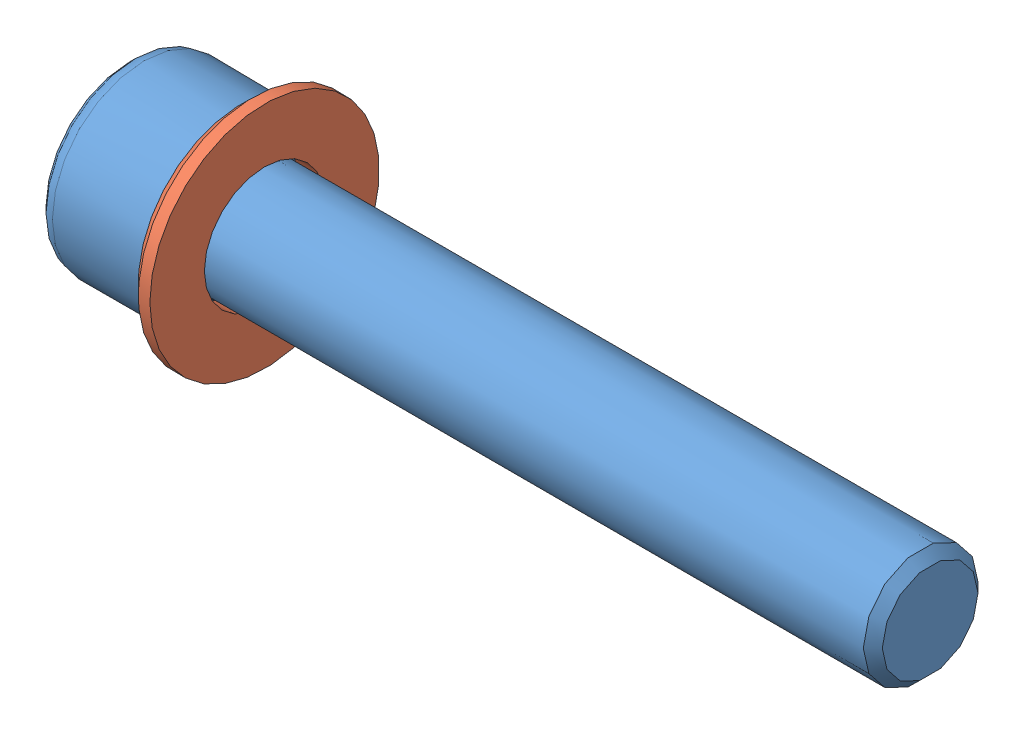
SolidWorks assembly Assemblage1.sldasm, configuration Défaut (file format 3400). Lengths in mm.
Overall size (70 20 20).
2 component instances, 2 part files, 2 mates.
Components (placement in the parent):
- Vis CHC M10 60-1: Vis CHC M10 60.SLDPRT [ISO 4762 M10 x 60 --- 60C] at origin size (70 16 16)
- Rondelle M10-1: Rondelle M10.SLDPRT [Washer ISO 7090 - 10] at (12 0 0) size (2 20 20)
Mates (geometry in assembly coordinates):
- Coaxiale11: concentric: cylinder of ?; cylinder of ?
- Coïncidente1: coincident anti-aligned: plane of ?; plane of ?
